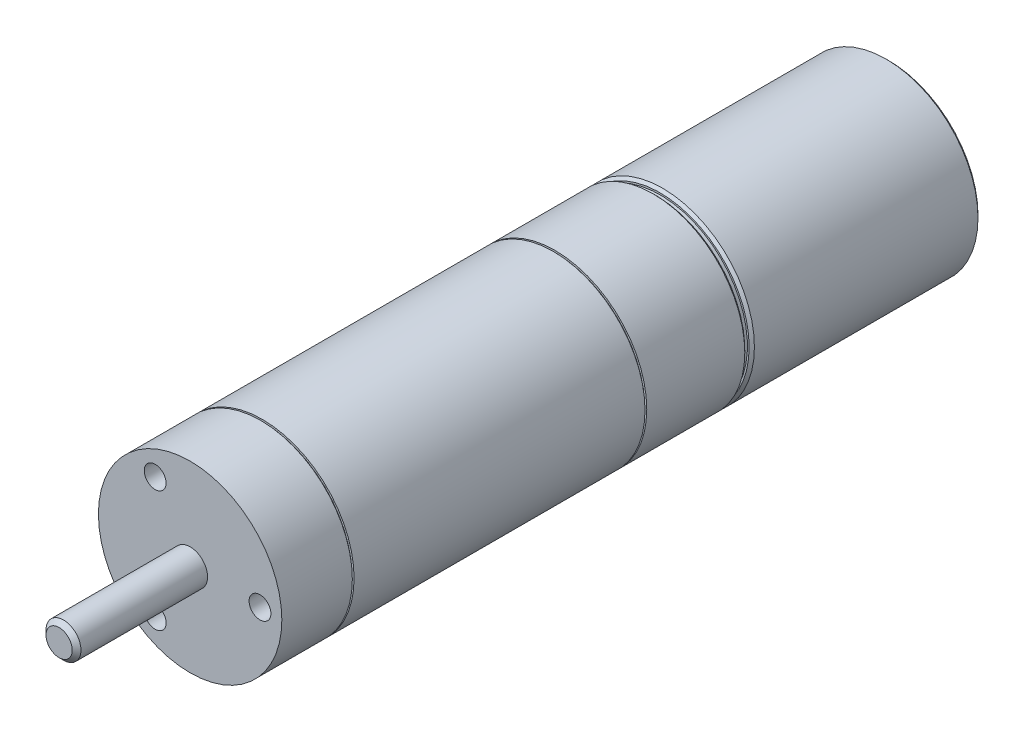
ISO-10303-21;
HEADER;
FILE_DESCRIPTION(('STEP AP214'),'2;1');
FILE_NAME('part.step','',(''),(''),'','','');
FILE_SCHEMA(('AUTOMOTIVE_DESIGN { 1 0 10303 214 1 1 1 1 }'));
ENDSEC;
DATA;
#1=APPLICATION_CONTEXT('core data for automotive mechanical design processes');
#2=APPLICATION_PROTOCOL_DEFINITION('international standard','automotive_design',2000,#1);
#3=PRODUCT_CONTEXT('',#1,'mechanical');
#4=PRODUCT('Part','Part','',(#3));
#5=PRODUCT_RELATED_PRODUCT_CATEGORY('part','',(#4));
#6=PRODUCT_DEFINITION_FORMATION('','',#4);
#7=PRODUCT_DEFINITION_CONTEXT('part definition',#1,'design');
#8=PRODUCT_DEFINITION('design','',#6,#7);
#9=PRODUCT_DEFINITION_SHAPE('','',#8);
#10=(LENGTH_UNIT() NAMED_UNIT(*) SI_UNIT(.MILLI.,.METRE.));
#11=(NAMED_UNIT(*) PLANE_ANGLE_UNIT() SI_UNIT($,.RADIAN.));
#12=(NAMED_UNIT(*) SI_UNIT($,.STERADIAN.) SOLID_ANGLE_UNIT());
#13=UNCERTAINTY_MEASURE_WITH_UNIT(LENGTH_MEASURE(1.E-05),#10,'distance_accuracy_value','');
#14=(GEOMETRIC_REPRESENTATION_CONTEXT(3) GLOBAL_UNCERTAINTY_ASSIGNED_CONTEXT((#13)) GLOBAL_UNIT_ASSIGNED_CONTEXT((#10,
#11,#12)) REPRESENTATION_CONTEXT('',''));
#15=CARTESIAN_POINT('',(0.,0.,0.));
#16=DIRECTION('',(0.,0.,1.));
#17=DIRECTION('',(1.,0.,0.));
#18=AXIS2_PLACEMENT_3D('',#15,#16,#17);
#19=CARTESIAN_POINT('',(0.,0.,80.));
#20=DIRECTION('',(0.,0.,-1.));
#21=DIRECTION('',(-1.,0.,0.));
#22=AXIS2_PLACEMENT_3D('',#19,#20,#21);
#23=CYLINDRICAL_SURFACE('',#22,10.5);
#24=CARTESIAN_POINT('',(0.,0.,26.9977784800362));
#25=DIRECTION('',(0.,0.,-1.));
#26=DIRECTION('',(-1.,0.,0.));
#27=AXIS2_PLACEMENT_3D('',#24,#25,#26);
#28=CIRCLE('',#27,10.5);
#29=CARTESIAN_POINT('',(-10.5,0.,26.9977784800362));
#30=VERTEX_POINT('',#29);
#31=EDGE_CURVE('E10',#30,#30,#28,.F.);
#32=ORIENTED_EDGE('',*,*,#31,.T.);
#33=EDGE_LOOP('',(#32));
#34=FACE_BOUND('',#33,.T.);
#35=CARTESIAN_POINT('',(0.,0.,38.2215074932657));
#36=DIRECTION('',(0.,0.,1.));
#37=DIRECTION('',(1.,0.,0.));
#38=AXIS2_PLACEMENT_3D('',#35,#36,#37);
#39=CIRCLE('',#38,10.5);
#40=CARTESIAN_POINT('',(10.5,0.,38.2215074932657));
#41=VERTEX_POINT('',#40);
#42=EDGE_CURVE('E63',#41,#41,#39,.T.);
#43=ORIENTED_EDGE('',*,*,#42,.F.);
#44=EDGE_LOOP('',(#43));
#45=FACE_BOUND('',#44,.T.);
#46=ADVANCED_FACE('F36',(#34,#45),#23,.T.);
#47=CARTESIAN_POINT('',(0.,0.,71.7283946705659));
#48=DIRECTION('',(0.,0.,1.));
#49=DIRECTION('',(1.,0.,0.));
#50=AXIS2_PLACEMENT_3D('',#47,#48,#49);
#51=CIRCLE('',#50,10.5);
#52=CARTESIAN_POINT('',(10.5,0.,71.7283946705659));
#53=VERTEX_POINT('',#52);
#54=EDGE_CURVE('E75',#53,#53,#51,.T.);
#55=ORIENTED_EDGE('',*,*,#54,.F.);
#56=EDGE_LOOP('',(#55));
#57=FACE_BOUND('',#56,.T.);
#58=CARTESIAN_POINT('',(0.,0.,38.4215074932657));
#59=DIRECTION('',(0.,0.,-1.));
#60=DIRECTION('',(-1.,0.,0.));
#61=AXIS2_PLACEMENT_3D('',#58,#59,#60);
#62=CIRCLE('',#61,10.5);
#63=CARTESIAN_POINT('',(-10.5,0.,38.4215074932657));
#64=VERTEX_POINT('',#63);
#65=EDGE_CURVE('E67',#64,#64,#62,.T.);
#66=ORIENTED_EDGE('',*,*,#65,.F.);
#67=EDGE_LOOP('',(#66));
#68=FACE_BOUND('',#67,.T.);
#69=ADVANCED_FACE('F143',(#57,#68),#23,.T.);
#70=CARTESIAN_POINT('',(0.,0.,80.));
#71=DIRECTION('',(0.,0.,1.));
#72=DIRECTION('',(1.,0.,0.));
#73=AXIS2_PLACEMENT_3D('',#70,#71,#72);
#74=CIRCLE('',#73,10.5);
#75=CARTESIAN_POINT('',(10.5,0.,80.));
#76=VERTEX_POINT('',#75);
#77=EDGE_CURVE('E84',#76,#76,#74,.T.);
#78=ORIENTED_EDGE('',*,*,#77,.F.);
#79=EDGE_LOOP('',(#78));
#80=FACE_BOUND('',#79,.T.);
#81=CARTESIAN_POINT('',(0.,0.,71.9283946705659));
#82=DIRECTION('',(0.,0.,-1.));
#83=DIRECTION('',(-1.,0.,0.));
#84=AXIS2_PLACEMENT_3D('',#81,#82,#83);
#85=CIRCLE('',#84,10.5);
#86=CARTESIAN_POINT('',(-10.5,0.,71.9283946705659));
#87=VERTEX_POINT('',#86);
#88=EDGE_CURVE('E71',#87,#87,#85,.T.);
#89=ORIENTED_EDGE('',*,*,#88,.F.);
#90=EDGE_LOOP('',(#89));
#91=FACE_BOUND('',#90,.T.);
#92=ADVANCED_FACE('F145',(#80,#91),#23,.T.);
#93=CARTESIAN_POINT('',(0.,0.,80.));
#94=DIRECTION('',(0.,0.,1.));
#95=DIRECTION('',(1.,0.,0.));
#96=AXIS2_PLACEMENT_3D('',#93,#94,#95);
#97=PLANE('',#96);
#98=CARTESIAN_POINT('',(-4.00000000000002,-6.9282032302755,80.));
#99=DIRECTION('',(0.,0.,1.));
#100=DIRECTION('',(1.,0.,0.));
#101=AXIS2_PLACEMENT_3D('',#98,#99,#100);
#102=CIRCLE('',#101,1.25);
#103=CARTESIAN_POINT('',(-2.75000000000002,-6.9282032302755,80.));
#104=VERTEX_POINT('',#103);
#105=EDGE_CURVE('E74',#104,#104,#102,.T.);
#106=ORIENTED_EDGE('',*,*,#105,.F.);
#107=EDGE_LOOP('',(#106));
#108=FACE_BOUND('',#107,.T.);
#109=CARTESIAN_POINT('',(8.,0.,80.));
#110=DIRECTION('',(0.,0.,1.));
#111=DIRECTION('',(1.,0.,0.));
#112=AXIS2_PLACEMENT_3D('',#109,#110,#111);
#113=CIRCLE('',#112,1.25);
#114=CARTESIAN_POINT('',(9.25,0.,80.));
#115=VERTEX_POINT('',#114);
#116=EDGE_CURVE('E97',#115,#115,#113,.T.);
#117=ORIENTED_EDGE('',*,*,#116,.F.);
#118=EDGE_LOOP('',(#117));
#119=FACE_BOUND('',#118,.T.);
#120=CARTESIAN_POINT('',(-3.99999999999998,6.92820323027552,80.));
#121=DIRECTION('',(0.,0.,1.));
#122=DIRECTION('',(1.,0.,0.));
#123=AXIS2_PLACEMENT_3D('',#120,#121,#122);
#124=CIRCLE('',#123,1.25);
#125=CARTESIAN_POINT('',(-2.74999999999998,6.92820323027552,80.));
#126=VERTEX_POINT('',#125);
#127=EDGE_CURVE('E91',#126,#126,#124,.T.);
#128=ORIENTED_EDGE('',*,*,#127,.F.);
#129=EDGE_LOOP('',(#128));
#130=FACE_BOUND('',#129,.T.);
#131=ORIENTED_EDGE('',*,*,#77,.T.);
#132=EDGE_LOOP('',(#131));
#133=FACE_BOUND('',#132,.T.);
#134=CARTESIAN_POINT('',(0.,0.,80.));
#135=DIRECTION('',(0.,0.,1.));
#136=DIRECTION('',(1.,0.,0.));
#137=AXIS2_PLACEMENT_3D('',#134,#135,#136);
#138=CIRCLE('',#137,2.);
#139=CARTESIAN_POINT('',(2.,0.,80.));
#140=VERTEX_POINT('',#139);
#141=EDGE_CURVE('E87',#140,#140,#138,.T.);
#142=ORIENTED_EDGE('',*,*,#141,.F.);
#143=EDGE_LOOP('',(#142));
#144=FACE_BOUND('',#143,.T.);
#145=ADVANCED_FACE('F156',(#108,#119,#130,#133,#144),#97,.T.);
#146=CARTESIAN_POINT('',(0.,0.,95.));
#147=DIRECTION('',(0.,0.,-1.));
#148=DIRECTION('',(-1.,0.,0.));
#149=AXIS2_PLACEMENT_3D('',#146,#147,#148);
#150=CYLINDRICAL_SURFACE('',#149,2.);
#151=CARTESIAN_POINT('',(0.,0.,94.5));
#152=DIRECTION('',(0.,0.,1.));
#153=DIRECTION('',(1.,0.,0.));
#154=AXIS2_PLACEMENT_3D('',#151,#152,#153);
#155=CIRCLE('',#154,2.);
#156=CARTESIAN_POINT('',(2.,0.,94.5));
#157=VERTEX_POINT('',#156);
#158=EDGE_CURVE('E62',#157,#157,#155,.F.);
#159=ORIENTED_EDGE('',*,*,#158,.T.);
#160=EDGE_LOOP('',(#159));
#161=FACE_BOUND('',#160,.T.);
#162=ORIENTED_EDGE('',*,*,#141,.T.);
#163=EDGE_LOOP('',(#162));
#164=FACE_BOUND('',#163,.T.);
#165=ADVANCED_FACE('F161',(#161,#164),#150,.T.);
#166=CARTESIAN_POINT('',(0.,0.,95.));
#167=DIRECTION('',(0.,0.,1.));
#168=DIRECTION('',(1.,0.,0.));
#169=AXIS2_PLACEMENT_3D('',#166,#167,#168);
#170=PLANE('',#169);
#171=CARTESIAN_POINT('',(0.,0.,95.));
#172=DIRECTION('',(0.,0.,1.));
#173=DIRECTION('',(1.,0.,0.));
#174=AXIS2_PLACEMENT_3D('',#171,#172,#173);
#175=CIRCLE('',#174,1.50000000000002);
#176=CARTESIAN_POINT('',(1.50000000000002,0.,95.));
#177=VERTEX_POINT('',#176);
#178=EDGE_CURVE('E81',#177,#177,#175,.T.);
#179=ORIENTED_EDGE('',*,*,#178,.T.);
#180=EDGE_LOOP('',(#179));
#181=FACE_BOUND('',#180,.T.);
#182=ADVANCED_FACE('F207',(#181),#170,.T.);
#183=CARTESIAN_POINT('',(0.,0.,95.));
#184=DIRECTION('',(0.,0.,-1.));
#185=DIRECTION('',(-1.,0.,0.));
#186=AXIS2_PLACEMENT_3D('',#183,#184,#185);
#187=CONICAL_SURFACE('',#186,1.50000000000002,0.785398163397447);
#188=ORIENTED_EDGE('',*,*,#158,.F.);
#189=EDGE_LOOP('',(#188));
#190=FACE_BOUND('',#189,.T.);
#191=ORIENTED_EDGE('',*,*,#178,.F.);
#192=EDGE_LOOP('',(#191));
#193=FACE_BOUND('',#192,.T.);
#194=ADVANCED_FACE('F205',(#190,#193),#187,.T.);
#195=CARTESIAN_POINT('',(-3.99999999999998,6.92820323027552,75.));
#196=DIRECTION('',(0.,0.,1.));
#197=DIRECTION('',(1.,0.,0.));
#198=AXIS2_PLACEMENT_3D('',#195,#196,#197);
#199=CYLINDRICAL_SURFACE('',#198,1.25);
#200=CARTESIAN_POINT('',(-3.99999999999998,6.92820323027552,75.));
#201=DIRECTION('',(0.,0.,1.));
#202=DIRECTION('',(1.,0.,0.));
#203=AXIS2_PLACEMENT_3D('',#200,#201,#202);
#204=CIRCLE('',#203,1.25);
#205=CARTESIAN_POINT('',(-2.74999999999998,6.92820323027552,75.));
#206=VERTEX_POINT('',#205);
#207=EDGE_CURVE('E90',#206,#206,#204,.T.);
#208=ORIENTED_EDGE('',*,*,#207,.F.);
#209=EDGE_LOOP('',(#208));
#210=FACE_BOUND('',#209,.T.);
#211=ORIENTED_EDGE('',*,*,#127,.T.);
#212=EDGE_LOOP('',(#211));
#213=FACE_BOUND('',#212,.T.);
#214=ADVANCED_FACE('F201',(#210,#213),#199,.F.);
#215=CARTESIAN_POINT('',(-3.99999999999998,6.92820323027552,75.));
#216=DIRECTION('',(0.,0.,1.));
#217=DIRECTION('',(1.,0.,0.));
#218=AXIS2_PLACEMENT_3D('',#215,#216,#217);
#219=PLANE('',#218);
#220=ORIENTED_EDGE('',*,*,#207,.T.);
#221=EDGE_LOOP('',(#220));
#222=FACE_BOUND('',#221,.T.);
#223=ADVANCED_FACE('F197',(#222),#219,.T.);
#224=CARTESIAN_POINT('',(8.,0.,75.));
#225=DIRECTION('',(0.,0.,1.));
#226=DIRECTION('',(1.,0.,0.));
#227=AXIS2_PLACEMENT_3D('',#224,#225,#226);
#228=CYLINDRICAL_SURFACE('',#227,1.25);
#229=CARTESIAN_POINT('',(8.,0.,75.));
#230=DIRECTION('',(0.,0.,1.));
#231=DIRECTION('',(1.,0.,0.));
#232=AXIS2_PLACEMENT_3D('',#229,#230,#231);
#233=CIRCLE('',#232,1.25);
#234=CARTESIAN_POINT('',(9.25,0.,75.));
#235=VERTEX_POINT('',#234);
#236=EDGE_CURVE('E94',#235,#235,#233,.T.);
#237=ORIENTED_EDGE('',*,*,#236,.F.);
#238=EDGE_LOOP('',(#237));
#239=FACE_BOUND('',#238,.T.);
#240=ORIENTED_EDGE('',*,*,#116,.T.);
#241=EDGE_LOOP('',(#240));
#242=FACE_BOUND('',#241,.T.);
#243=ADVANCED_FACE('F193',(#239,#242),#228,.F.);
#244=CARTESIAN_POINT('',(8.,0.,75.));
#245=DIRECTION('',(0.,0.,1.));
#246=DIRECTION('',(1.,0.,0.));
#247=AXIS2_PLACEMENT_3D('',#244,#245,#246);
#248=PLANE('',#247);
#249=ORIENTED_EDGE('',*,*,#236,.T.);
#250=EDGE_LOOP('',(#249));
#251=FACE_BOUND('',#250,.T.);
#252=ADVANCED_FACE('F189',(#251),#248,.T.);
#253=CARTESIAN_POINT('',(-4.00000000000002,-6.9282032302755,75.));
#254=DIRECTION('',(0.,0.,1.));
#255=DIRECTION('',(1.,0.,0.));
#256=AXIS2_PLACEMENT_3D('',#253,#254,#255);
#257=CYLINDRICAL_SURFACE('',#256,1.25);
#258=CARTESIAN_POINT('',(-4.00000000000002,-6.9282032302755,75.));
#259=DIRECTION('',(0.,0.,1.));
#260=DIRECTION('',(1.,0.,0.));
#261=AXIS2_PLACEMENT_3D('',#258,#259,#260);
#262=CIRCLE('',#261,1.25);
#263=CARTESIAN_POINT('',(-2.75000000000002,-6.9282032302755,75.));
#264=VERTEX_POINT('',#263);
#265=EDGE_CURVE('E100',#264,#264,#262,.T.);
#266=ORIENTED_EDGE('',*,*,#265,.F.);
#267=EDGE_LOOP('',(#266));
#268=FACE_BOUND('',#267,.T.);
#269=ORIENTED_EDGE('',*,*,#105,.T.);
#270=EDGE_LOOP('',(#269));
#271=FACE_BOUND('',#270,.T.);
#272=ADVANCED_FACE('F181',(#268,#271),#257,.F.);
#273=CARTESIAN_POINT('',(-4.00000000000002,-6.9282032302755,75.));
#274=DIRECTION('',(0.,0.,1.));
#275=DIRECTION('',(1.,0.,0.));
#276=AXIS2_PLACEMENT_3D('',#273,#274,#275);
#277=PLANE('',#276);
#278=ORIENTED_EDGE('',*,*,#265,.T.);
#279=EDGE_LOOP('',(#278));
#280=FACE_BOUND('',#279,.T.);
#281=ADVANCED_FACE('F171',(#280),#277,.T.);
#282=CARTESIAN_POINT('',(-11.5069297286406,0.,71.9283946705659));
#283=DIRECTION('',(0.,0.,-1.));
#284=DIRECTION('',(-1.,0.,0.));
#285=AXIS2_PLACEMENT_3D('',#282,#283,#284);
#286=PLANE('',#285);
#287=CARTESIAN_POINT('',(0.,0.,71.9283946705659));
#288=DIRECTION('',(0.,0.,-1.));
#289=DIRECTION('',(-1.,0.,0.));
#290=AXIS2_PLACEMENT_3D('',#287,#288,#289);
#291=CIRCLE('',#290,10.2762378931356);
#292=CARTESIAN_POINT('',(-10.2762378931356,0.,71.9283946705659));
#293=VERTEX_POINT('',#292);
#294=EDGE_CURVE('E78',#293,#293,#291,.T.);
#295=ORIENTED_EDGE('',*,*,#294,.F.);
#296=EDGE_LOOP('',(#295));
#297=FACE_BOUND('',#296,.T.);
#298=ORIENTED_EDGE('',*,*,#88,.T.);
#299=EDGE_LOOP('',(#298));
#300=FACE_BOUND('',#299,.T.);
#301=ADVANCED_FACE('F168',(#297,#300),#286,.T.);
#302=CARTESIAN_POINT('',(-11.5069297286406,0.,71.7283946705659));
#303=DIRECTION('',(0.,0.,1.));
#304=DIRECTION('',(1.,0.,0.));
#305=AXIS2_PLACEMENT_3D('',#302,#303,#304);
#306=PLANE('',#305);
#307=CARTESIAN_POINT('',(0.,0.,71.7283946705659));
#308=DIRECTION('',(0.,0.,-1.));
#309=DIRECTION('',(-1.,0.,0.));
#310=AXIS2_PLACEMENT_3D('',#307,#308,#309);
#311=CIRCLE('',#310,10.2762378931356);
#312=CARTESIAN_POINT('',(-10.2762378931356,0.,71.7283946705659));
#313=VERTEX_POINT('',#312);
#314=EDGE_CURVE('E66',#313,#313,#311,.T.);
#315=ORIENTED_EDGE('',*,*,#314,.T.);
#316=EDGE_LOOP('',(#315));
#317=FACE_BOUND('',#316,.T.);
#318=ORIENTED_EDGE('',*,*,#54,.T.);
#319=EDGE_LOOP('',(#318));
#320=FACE_BOUND('',#319,.T.);
#321=ADVANCED_FACE('F170',(#317,#320),#306,.T.);
#322=CARTESIAN_POINT('',(0.,0.,-6.64114582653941));
#323=DIRECTION('',(0.,0.,-1.));
#324=DIRECTION('',(-1.,0.,0.));
#325=AXIS2_PLACEMENT_3D('',#322,#323,#324);
#326=CYLINDRICAL_SURFACE('',#325,10.2762378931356);
#327=ORIENTED_EDGE('',*,*,#294,.T.);
#328=EDGE_LOOP('',(#327));
#329=FACE_BOUND('',#328,.T.);
#330=ORIENTED_EDGE('',*,*,#314,.F.);
#331=EDGE_LOOP('',(#330));
#332=FACE_BOUND('',#331,.T.);
#333=ADVANCED_FACE('F178',(#329,#332),#326,.T.);
#334=CARTESIAN_POINT('',(-10.2762378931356,0.,38.2215074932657));
#335=DIRECTION('',(0.,0.,1.));
#336=DIRECTION('',(1.,0.,0.));
#337=AXIS2_PLACEMENT_3D('',#334,#335,#336);
#338=PLANE('',#337);
#339=CARTESIAN_POINT('',(0.,0.,38.2215074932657));
#340=DIRECTION('',(0.,0.,-1.));
#341=DIRECTION('',(-1.,0.,0.));
#342=AXIS2_PLACEMENT_3D('',#339,#340,#341);
#343=CIRCLE('',#342,10.2762378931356);
#344=CARTESIAN_POINT('',(-10.2762378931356,0.,38.2215074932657));
#345=VERTEX_POINT('',#344);
#346=EDGE_CURVE('E70',#345,#345,#343,.T.);
#347=ORIENTED_EDGE('',*,*,#346,.T.);
#348=EDGE_LOOP('',(#347));
#349=FACE_BOUND('',#348,.T.);
#350=ORIENTED_EDGE('',*,*,#42,.T.);
#351=EDGE_LOOP('',(#350));
#352=FACE_BOUND('',#351,.T.);
#353=ADVANCED_FACE('F316',(#349,#352),#338,.T.);
#354=CARTESIAN_POINT('',(-10.2762378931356,0.,38.4215074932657));
#355=DIRECTION('',(0.,0.,-1.));
#356=DIRECTION('',(-1.,0.,0.));
#357=AXIS2_PLACEMENT_3D('',#354,#355,#356);
#358=PLANE('',#357);
#359=CARTESIAN_POINT('',(0.,0.,38.4215074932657));
#360=DIRECTION('',(0.,0.,-1.));
#361=DIRECTION('',(-1.,0.,0.));
#362=AXIS2_PLACEMENT_3D('',#359,#360,#361);
#363=CIRCLE('',#362,10.2762378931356);
#364=CARTESIAN_POINT('',(-10.2762378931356,0.,38.4215074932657));
#365=VERTEX_POINT('',#364);
#366=EDGE_CURVE('E113',#365,#365,#363,.T.);
#367=ORIENTED_EDGE('',*,*,#366,.F.);
#368=EDGE_LOOP('',(#367));
#369=FACE_BOUND('',#368,.T.);
#370=ORIENTED_EDGE('',*,*,#65,.T.);
#371=EDGE_LOOP('',(#370));
#372=FACE_BOUND('',#371,.T.);
#373=ADVANCED_FACE('F306',(#369,#372),#358,.T.);
#374=CARTESIAN_POINT('',(0.,0.,-6.64114582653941));
#375=DIRECTION('',(0.,0.,-1.));
#376=DIRECTION('',(-1.,0.,0.));
#377=AXIS2_PLACEMENT_3D('',#374,#375,#376);
#378=CYLINDRICAL_SURFACE('',#377,10.2762378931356);
#379=ORIENTED_EDGE('',*,*,#366,.T.);
#380=EDGE_LOOP('',(#379));
#381=FACE_BOUND('',#380,.T.);
#382=ORIENTED_EDGE('',*,*,#346,.F.);
#383=EDGE_LOOP('',(#382));
#384=FACE_BOUND('',#383,.T.);
#385=ADVANCED_FACE('F287',(#381,#384),#378,.T.);
#386=CARTESIAN_POINT('',(-10.,0.,26.6977784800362));
#387=DIRECTION('',(0.,0.,-1.));
#388=DIRECTION('',(-1.,0.,0.));
#389=AXIS2_PLACEMENT_3D('',#386,#387,#388);
#390=PLANE('',#389);
#391=CARTESIAN_POINT('',(0.,0.,26.6977784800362));
#392=DIRECTION('',(0.,0.,-1.));
#393=DIRECTION('',(-1.,0.,0.));
#394=AXIS2_PLACEMENT_3D('',#391,#392,#393);
#395=CIRCLE('',#394,10.2);
#396=CARTESIAN_POINT('',(-10.2,0.,26.6977784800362));
#397=VERTEX_POINT('',#396);
#398=EDGE_CURVE('E43',#397,#397,#395,.T.);
#399=ORIENTED_EDGE('',*,*,#398,.T.);
#400=EDGE_LOOP('',(#399));
#401=FACE_BOUND('',#400,.T.);
#402=CARTESIAN_POINT('',(0.,0.,26.6977784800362));
#403=DIRECTION('',(0.,0.,-1.));
#404=DIRECTION('',(-1.,0.,0.));
#405=AXIS2_PLACEMENT_3D('',#402,#403,#404);
#406=CIRCLE('',#405,10.);
#407=CARTESIAN_POINT('',(-10.,0.,26.6977784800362));
#408=VERTEX_POINT('',#407);
#409=EDGE_CURVE('E116',#408,#408,#406,.T.);
#410=ORIENTED_EDGE('',*,*,#409,.F.);
#411=EDGE_LOOP('',(#410));
#412=FACE_BOUND('',#411,.T.);
#413=ADVANCED_FACE('F137',(#401,#412),#390,.T.);
#414=CARTESIAN_POINT('',(-10.,0.,26.1977784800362));
#415=DIRECTION('',(0.,0.,1.));
#416=DIRECTION('',(1.,0.,0.));
#417=AXIS2_PLACEMENT_3D('',#414,#415,#416);
#418=PLANE('',#417);
#419=CARTESIAN_POINT('',(0.,0.,26.1977784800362));
#420=DIRECTION('',(0.,0.,1.));
#421=DIRECTION('',(1.,0.,0.));
#422=AXIS2_PLACEMENT_3D('',#419,#420,#421);
#423=CIRCLE('',#422,10.2);
#424=CARTESIAN_POINT('',(10.2,0.,26.1977784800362));
#425=VERTEX_POINT('',#424);
#426=EDGE_CURVE('E59',#425,#425,#423,.T.);
#427=ORIENTED_EDGE('',*,*,#426,.T.);
#428=EDGE_LOOP('',(#427));
#429=FACE_BOUND('',#428,.T.);
#430=CARTESIAN_POINT('',(0.,0.,26.1977784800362));
#431=DIRECTION('',(0.,0.,-1.));
#432=DIRECTION('',(-1.,0.,0.));
#433=AXIS2_PLACEMENT_3D('',#430,#431,#432);
#434=CIRCLE('',#433,10.);
#435=CARTESIAN_POINT('',(-10.,0.,26.1977784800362));
#436=VERTEX_POINT('',#435);
#437=EDGE_CURVE('E119',#436,#436,#434,.T.);
#438=ORIENTED_EDGE('',*,*,#437,.T.);
#439=EDGE_LOOP('',(#438));
#440=FACE_BOUND('',#439,.T.);
#441=ADVANCED_FACE('F123',(#429,#440),#418,.T.);
#442=CARTESIAN_POINT('',(0.,0.,-6.64114582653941));
#443=DIRECTION('',(0.,0.,-1.));
#444=DIRECTION('',(-1.,0.,0.));
#445=AXIS2_PLACEMENT_3D('',#442,#443,#444);
#446=CYLINDRICAL_SURFACE('',#445,10.);
#447=ORIENTED_EDGE('',*,*,#409,.T.);
#448=EDGE_LOOP('',(#447));
#449=FACE_BOUND('',#448,.T.);
#450=ORIENTED_EDGE('',*,*,#437,.F.);
#451=EDGE_LOOP('',(#450));
#452=FACE_BOUND('',#451,.T.);
#453=ADVANCED_FACE('F125',(#449,#452),#446,.T.);
#454=CARTESIAN_POINT('',(0.,0.,0.));
#455=DIRECTION('',(0.,0.,1.));
#456=DIRECTION('',(1.,0.,0.));
#457=AXIS2_PLACEMENT_3D('',#454,#455,#456);
#458=PLANE('',#457);
#459=CARTESIAN_POINT('',(0.,0.,0.));
#460=DIRECTION('',(0.,0.,1.));
#461=DIRECTION('',(1.,0.,0.));
#462=AXIS2_PLACEMENT_3D('',#459,#460,#461);
#463=CIRCLE('',#462,10.2);
#464=CARTESIAN_POINT('',(10.2,0.,0.));
#465=VERTEX_POINT('',#464);
#466=EDGE_CURVE('E47',#465,#465,#463,.F.);
#467=ORIENTED_EDGE('',*,*,#466,.T.);
#468=EDGE_LOOP('',(#467));
#469=FACE_BOUND('',#468,.T.);
#470=ADVANCED_FACE('F127',(#469),#458,.F.);
#471=CARTESIAN_POINT('',(0.,0.,25.8977784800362));
#472=DIRECTION('',(0.,0.,1.));
#473=DIRECTION('',(1.,0.,0.));
#474=AXIS2_PLACEMENT_3D('',#471,#472,#473);
#475=CIRCLE('',#474,10.5);
#476=CARTESIAN_POINT('',(10.5,0.,25.8977784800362));
#477=VERTEX_POINT('',#476);
#478=EDGE_CURVE('E51',#477,#477,#475,.F.);
#479=ORIENTED_EDGE('',*,*,#478,.T.);
#480=EDGE_LOOP('',(#479));
#481=FACE_BOUND('',#480,.T.);
#482=CARTESIAN_POINT('',(0.,0.,0.299999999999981));
#483=DIRECTION('',(0.,0.,1.));
#484=DIRECTION('',(1.,0.,0.));
#485=AXIS2_PLACEMENT_3D('',#482,#483,#484);
#486=CIRCLE('',#485,10.5);
#487=CARTESIAN_POINT('',(10.5,0.,0.299999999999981));
#488=VERTEX_POINT('',#487);
#489=EDGE_CURVE('E56',#488,#488,#486,.T.);
#490=ORIENTED_EDGE('',*,*,#489,.T.);
#491=EDGE_LOOP('',(#490));
#492=FACE_BOUND('',#491,.T.);
#493=ADVANCED_FACE('F134',(#481,#492),#23,.T.);
#494=CARTESIAN_POINT('',(0.,0.,26.1977784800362));
#495=DIRECTION('',(0.,0.,-1.));
#496=DIRECTION('',(-1.,0.,0.));
#497=AXIS2_PLACEMENT_3D('',#494,#495,#496);
#498=CONICAL_SURFACE('',#497,10.2,0.785398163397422);
#499=ORIENTED_EDGE('',*,*,#478,.F.);
#500=EDGE_LOOP('',(#499));
#501=FACE_BOUND('',#500,.T.);
#502=ORIENTED_EDGE('',*,*,#426,.F.);
#503=EDGE_LOOP('',(#502));
#504=FACE_BOUND('',#503,.T.);
#505=ADVANCED_FACE('F153',(#501,#504),#498,.T.);
#506=CARTESIAN_POINT('',(0.,0.,0.299999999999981));
#507=DIRECTION('',(0.,0.,1.));
#508=DIRECTION('',(1.,0.,0.));
#509=AXIS2_PLACEMENT_3D('',#506,#507,#508);
#510=CONICAL_SURFACE('',#509,10.5,0.785398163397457);
#511=ORIENTED_EDGE('',*,*,#466,.F.);
#512=EDGE_LOOP('',(#511));
#513=FACE_BOUND('',#512,.T.);
#514=ORIENTED_EDGE('',*,*,#489,.F.);
#515=EDGE_LOOP('',(#514));
#516=FACE_BOUND('',#515,.T.);
#517=ADVANCED_FACE('F227',(#513,#516),#510,.T.);
#518=CARTESIAN_POINT('',(0.,0.,26.6977784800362));
#519=DIRECTION('',(0.,0.,1.));
#520=DIRECTION('',(1.,0.,0.));
#521=AXIS2_PLACEMENT_3D('',#518,#519,#520);
#522=CONICAL_SURFACE('',#521,10.2,0.785398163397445);
#523=ORIENTED_EDGE('',*,*,#31,.F.);
#524=EDGE_LOOP('',(#523));
#525=FACE_BOUND('',#524,.T.);
#526=ORIENTED_EDGE('',*,*,#398,.F.);
#527=EDGE_LOOP('',(#526));
#528=FACE_BOUND('',#527,.T.);
#529=ADVANCED_FACE('F38',(#525,#528),#522,.T.);
#530=CLOSED_SHELL('',(#46,#69,#92,#145,#165,#182,#194,#214,#223,#243,#252,#272,#281,#301,#321,
#333,#353,#373,#385,#413,#441,#453,#470,#493,#505,#517,#529));
#531=MANIFOLD_SOLID_BREP('B2',#530);
#532=ADVANCED_BREP_SHAPE_REPRESENTATION('',(#18,#531),#14);
#533=SHAPE_DEFINITION_REPRESENTATION(#9,#532);
ENDSEC;
END-ISO-10303-21;
